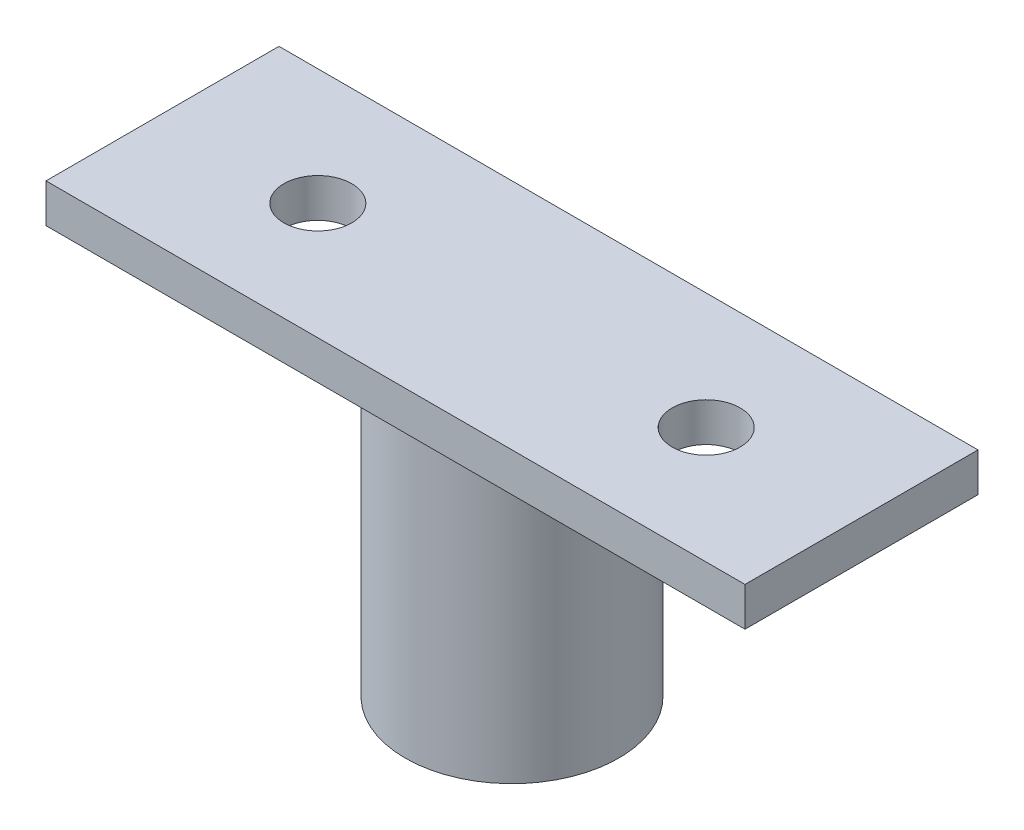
ISO-10303-21;
HEADER;
FILE_DESCRIPTION(('STEP AP214'),'2;1');
FILE_NAME('part.step','',(''),(''),'','','');
FILE_SCHEMA(('AUTOMOTIVE_DESIGN { 1 0 10303 214 1 1 1 1 }'));
ENDSEC;
DATA;
#1=APPLICATION_CONTEXT('core data for automotive mechanical design processes');
#2=APPLICATION_PROTOCOL_DEFINITION('international standard','automotive_design',2000,#1);
#3=PRODUCT_CONTEXT('',#1,'mechanical');
#4=PRODUCT('Part','Part','',(#3));
#5=PRODUCT_RELATED_PRODUCT_CATEGORY('part','',(#4));
#6=PRODUCT_DEFINITION_FORMATION('','',#4);
#7=PRODUCT_DEFINITION_CONTEXT('part definition',#1,'design');
#8=PRODUCT_DEFINITION('design','',#6,#7);
#9=PRODUCT_DEFINITION_SHAPE('','',#8);
#10=(LENGTH_UNIT() NAMED_UNIT(*) SI_UNIT(.MILLI.,.METRE.));
#11=(NAMED_UNIT(*) PLANE_ANGLE_UNIT() SI_UNIT($,.RADIAN.));
#12=(NAMED_UNIT(*) SI_UNIT($,.STERADIAN.) SOLID_ANGLE_UNIT());
#13=UNCERTAINTY_MEASURE_WITH_UNIT(LENGTH_MEASURE(1.E-05),#10,'distance_accuracy_value','');
#14=(GEOMETRIC_REPRESENTATION_CONTEXT(3) GLOBAL_UNCERTAINTY_ASSIGNED_CONTEXT((#13)) GLOBAL_UNIT_ASSIGNED_CONTEXT((#10,
#11,#12)) REPRESENTATION_CONTEXT('',''));
#15=CARTESIAN_POINT('',(0.,0.,0.));
#16=DIRECTION('',(0.,0.,1.));
#17=DIRECTION('',(1.,0.,0.));
#18=AXIS2_PLACEMENT_3D('',#15,#16,#17);
#19=CARTESIAN_POINT('',(0.,0.,0.));
#20=DIRECTION('',(0.,1.,0.));
#21=DIRECTION('',(0.,0.,1.));
#22=AXIS2_PLACEMENT_3D('',#19,#20,#21);
#23=PLANE('',#22);
#24=CARTESIAN_POINT('',(0.,0.,0.));
#25=DIRECTION('',(0.,1.,0.));
#26=DIRECTION('',(0.,0.,1.));
#27=AXIS2_PLACEMENT_3D('',#24,#25,#26);
#28=CIRCLE('',#27,5.5);
#29=CARTESIAN_POINT('',(0.,0.,5.5));
#30=VERTEX_POINT('',#29);
#31=EDGE_CURVE('E34',#30,#30,#28,.T.);
#32=ORIENTED_EDGE('',*,*,#31,.F.);
#33=EDGE_LOOP('',(#32));
#34=FACE_BOUND('',#33,.T.);
#35=CARTESIAN_POINT('',(0.,0.,0.));
#36=DIRECTION('',(0.,1.,0.));
#37=DIRECTION('',(0.,0.,1.));
#38=AXIS2_PLACEMENT_3D('',#35,#36,#37);
#39=CIRCLE('',#38,4.);
#40=CARTESIAN_POINT('',(0.,0.,4.));
#41=VERTEX_POINT('',#40);
#42=EDGE_CURVE('E111',#41,#41,#39,.T.);
#43=ORIENTED_EDGE('',*,*,#42,.T.);
#44=EDGE_LOOP('',(#43));
#45=FACE_BOUND('',#44,.T.);
#46=ADVANCED_FACE('F30',(#34,#45),#23,.F.);
#47=CARTESIAN_POINT('',(0.,15.,0.));
#48=DIRECTION('',(0.,-1.,0.));
#49=DIRECTION('',(0.,0.,-1.));
#50=AXIS2_PLACEMENT_3D('',#47,#48,#49);
#51=CYLINDRICAL_SURFACE('',#50,5.5);
#52=CARTESIAN_POINT('',(0.,15.,0.));
#53=DIRECTION('',(0.,1.,0.));
#54=DIRECTION('',(0.,0.,1.));
#55=AXIS2_PLACEMENT_3D('',#52,#53,#54);
#56=CIRCLE('',#55,5.5);
#57=CARTESIAN_POINT('',(0.,15.,5.5));
#58=VERTEX_POINT('',#57);
#59=EDGE_CURVE('E11',#58,#58,#56,.T.);
#60=ORIENTED_EDGE('',*,*,#59,.F.);
#61=EDGE_LOOP('',(#60));
#62=FACE_BOUND('',#61,.T.);
#63=ORIENTED_EDGE('',*,*,#31,.T.);
#64=EDGE_LOOP('',(#63));
#65=FACE_BOUND('',#64,.T.);
#66=ADVANCED_FACE('F32',(#62,#65),#51,.T.);
#67=CARTESIAN_POINT('',(0.,15.,0.));
#68=DIRECTION('',(0.,-1.,0.));
#69=DIRECTION('',(0.,0.,-1.));
#70=AXIS2_PLACEMENT_3D('',#67,#68,#69);
#71=CYLINDRICAL_SURFACE('',#70,4.);
#72=CARTESIAN_POINT('',(0.,15.,0.));
#73=DIRECTION('',(0.,1.,0.));
#74=DIRECTION('',(0.,0.,1.));
#75=AXIS2_PLACEMENT_3D('',#72,#73,#74);
#76=CIRCLE('',#75,4.);
#77=CARTESIAN_POINT('',(0.,15.,4.));
#78=VERTEX_POINT('',#77);
#79=EDGE_CURVE('E108',#78,#78,#76,.T.);
#80=ORIENTED_EDGE('',*,*,#79,.T.);
#81=EDGE_LOOP('',(#80));
#82=FACE_BOUND('',#81,.T.);
#83=ORIENTED_EDGE('',*,*,#42,.F.);
#84=EDGE_LOOP('',(#83));
#85=FACE_BOUND('',#84,.T.);
#86=ADVANCED_FACE('F123',(#82,#85),#71,.F.);
#87=CARTESIAN_POINT('',(-18.,15.,6.));
#88=DIRECTION('',(0.,1.,0.));
#89=DIRECTION('',(0.,0.,1.));
#90=AXIS2_PLACEMENT_3D('',#87,#88,#89);
#91=PLANE('',#90);
#92=ORIENTED_EDGE('',*,*,#79,.F.);
#93=EDGE_LOOP('',(#92));
#94=FACE_BOUND('',#93,.T.);
#95=ADVANCED_FACE('F128',(#94),#91,.F.);
#96=CARTESIAN_POINT('',(10.,15.,0.));
#97=DIRECTION('',(0.,1.,0.));
#98=DIRECTION('',(0.,0.,1.));
#99=AXIS2_PLACEMENT_3D('',#96,#97,#98);
#100=CIRCLE('',#99,1.75);
#101=CARTESIAN_POINT('',(10.,15.,1.74999999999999));
#102=VERTEX_POINT('',#101);
#103=EDGE_CURVE('E160',#102,#102,#100,.T.);
#104=ORIENTED_EDGE('',*,*,#103,.T.);
#105=EDGE_LOOP('',(#104));
#106=FACE_BOUND('',#105,.T.);
#107=CARTESIAN_POINT('',(-10.,15.,0.));
#108=DIRECTION('',(0.,1.,0.));
#109=DIRECTION('',(0.,0.,1.));
#110=AXIS2_PLACEMENT_3D('',#107,#108,#109);
#111=CIRCLE('',#110,1.75);
#112=CARTESIAN_POINT('',(-10.,15.,1.75));
#113=VERTEX_POINT('',#112);
#114=EDGE_CURVE('E101',#113,#113,#111,.T.);
#115=ORIENTED_EDGE('',*,*,#114,.T.);
#116=EDGE_LOOP('',(#115));
#117=FACE_BOUND('',#116,.T.);
#118=DIRECTION('',(0.,0.,1.));
#119=VECTOR('',#118,1.);
#120=CARTESIAN_POINT('',(-18.,15.,-6.));
#121=LINE('',#120,#119);
#122=CARTESIAN_POINT('',(-18.,15.,-6.));
#123=VERTEX_POINT('',#122);
#124=CARTESIAN_POINT('',(-18.,15.,6.));
#125=VERTEX_POINT('',#124);
#126=EDGE_CURVE('E98',#123,#125,#121,.T.);
#127=ORIENTED_EDGE('',*,*,#126,.F.);
#128=DIRECTION('',(-1.,0.,0.));
#129=VECTOR('',#128,1.);
#130=CARTESIAN_POINT('',(-18.,15.,-6.));
#131=LINE('',#130,#129);
#132=CARTESIAN_POINT('',(18.,15.,-6.));
#133=VERTEX_POINT('',#132);
#134=EDGE_CURVE('E70',#133,#123,#131,.T.);
#135=ORIENTED_EDGE('',*,*,#134,.F.);
#136=DIRECTION('',(0.,0.,-1.));
#137=VECTOR('',#136,1.);
#138=CARTESIAN_POINT('',(18.,15.,-6.));
#139=LINE('',#138,#137);
#140=CARTESIAN_POINT('',(18.,15.,6.));
#141=VERTEX_POINT('',#140);
#142=EDGE_CURVE('E64',#141,#133,#139,.T.);
#143=ORIENTED_EDGE('',*,*,#142,.F.);
#144=DIRECTION('',(1.,0.,0.));
#145=VECTOR('',#144,1.);
#146=CARTESIAN_POINT('',(-18.,15.,6.));
#147=LINE('',#146,#145);
#148=EDGE_CURVE('E88',#125,#141,#147,.T.);
#149=ORIENTED_EDGE('',*,*,#148,.F.);
#150=EDGE_LOOP('',(#127,#135,#143,#149));
#151=FACE_BOUND('',#150,.T.);
#152=ORIENTED_EDGE('',*,*,#59,.T.);
#153=EDGE_LOOP('',(#152));
#154=FACE_BOUND('',#153,.T.);
#155=ADVANCED_FACE('F133',(#106,#117,#151,#154),#91,.F.);
#156=CARTESIAN_POINT('',(-18.,17.,-6.));
#157=DIRECTION('',(1.,0.,0.));
#158=DIRECTION('',(0.,0.,-1.));
#159=AXIS2_PLACEMENT_3D('',#156,#157,#158);
#160=PLANE('',#159);
#161=ORIENTED_EDGE('',*,*,#126,.T.);
#162=DIRECTION('',(0.,-1.,0.));
#163=VECTOR('',#162,1.);
#164=CARTESIAN_POINT('',(-18.,17.,6.));
#165=LINE('',#164,#163);
#166=CARTESIAN_POINT('',(-18.,17.,6.));
#167=VERTEX_POINT('',#166);
#168=EDGE_CURVE('E89',#167,#125,#165,.T.);
#169=ORIENTED_EDGE('',*,*,#168,.F.);
#170=DIRECTION('',(0.,0.,1.));
#171=VECTOR('',#170,1.);
#172=CARTESIAN_POINT('',(-18.,17.,-6.));
#173=LINE('',#172,#171);
#174=CARTESIAN_POINT('',(-18.,17.,-6.));
#175=VERTEX_POINT('',#174);
#176=EDGE_CURVE('E83',#175,#167,#173,.T.);
#177=ORIENTED_EDGE('',*,*,#176,.F.);
#178=DIRECTION('',(0.,-1.,0.));
#179=VECTOR('',#178,1.);
#180=CARTESIAN_POINT('',(-18.,17.,-6.));
#181=LINE('',#180,#179);
#182=EDGE_CURVE('E94',#175,#123,#181,.T.);
#183=ORIENTED_EDGE('',*,*,#182,.T.);
#184=EDGE_LOOP('',(#161,#169,#177,#183));
#185=FACE_BOUND('',#184,.T.);
#186=ADVANCED_FACE('F130',(#185),#160,.F.);
#187=CARTESIAN_POINT('',(-18.,17.,6.));
#188=DIRECTION('',(0.,0.,-1.));
#189=DIRECTION('',(-1.,0.,0.));
#190=AXIS2_PLACEMENT_3D('',#187,#188,#189);
#191=PLANE('',#190);
#192=ORIENTED_EDGE('',*,*,#148,.T.);
#193=DIRECTION('',(0.,-1.,0.));
#194=VECTOR('',#193,1.);
#195=CARTESIAN_POINT('',(18.,17.,6.));
#196=LINE('',#195,#194);
#197=CARTESIAN_POINT('',(18.,17.,6.));
#198=VERTEX_POINT('',#197);
#199=EDGE_CURVE('E86',#198,#141,#196,.T.);
#200=ORIENTED_EDGE('',*,*,#199,.F.);
#201=DIRECTION('',(1.,0.,0.));
#202=VECTOR('',#201,1.);
#203=CARTESIAN_POINT('',(-18.,17.,6.));
#204=LINE('',#203,#202);
#205=EDGE_CURVE('E78',#167,#198,#204,.T.);
#206=ORIENTED_EDGE('',*,*,#205,.F.);
#207=ORIENTED_EDGE('',*,*,#168,.T.);
#208=EDGE_LOOP('',(#192,#200,#206,#207));
#209=FACE_BOUND('',#208,.T.);
#210=ADVANCED_FACE('F87',(#209),#191,.F.);
#211=CARTESIAN_POINT('',(18.,17.,-6.));
#212=DIRECTION('',(-1.,0.,0.));
#213=DIRECTION('',(0.,0.,1.));
#214=AXIS2_PLACEMENT_3D('',#211,#212,#213);
#215=PLANE('',#214);
#216=ORIENTED_EDGE('',*,*,#142,.T.);
#217=DIRECTION('',(0.,-1.,0.));
#218=VECTOR('',#217,1.);
#219=CARTESIAN_POINT('',(18.,17.,-6.));
#220=LINE('',#219,#218);
#221=CARTESIAN_POINT('',(18.,17.,-6.));
#222=VERTEX_POINT('',#221);
#223=EDGE_CURVE('E90',#222,#133,#220,.T.);
#224=ORIENTED_EDGE('',*,*,#223,.F.);
#225=DIRECTION('',(0.,0.,-1.));
#226=VECTOR('',#225,1.);
#227=CARTESIAN_POINT('',(18.,17.,-6.));
#228=LINE('',#227,#226);
#229=EDGE_CURVE('E81',#198,#222,#228,.T.);
#230=ORIENTED_EDGE('',*,*,#229,.F.);
#231=ORIENTED_EDGE('',*,*,#199,.T.);
#232=EDGE_LOOP('',(#216,#224,#230,#231));
#233=FACE_BOUND('',#232,.T.);
#234=ADVANCED_FACE('F92',(#233),#215,.F.);
#235=CARTESIAN_POINT('',(-18.,17.,-6.));
#236=DIRECTION('',(0.,0.,1.));
#237=DIRECTION('',(1.,0.,0.));
#238=AXIS2_PLACEMENT_3D('',#235,#236,#237);
#239=PLANE('',#238);
#240=ORIENTED_EDGE('',*,*,#134,.T.);
#241=ORIENTED_EDGE('',*,*,#182,.F.);
#242=DIRECTION('',(-1.,0.,0.));
#243=VECTOR('',#242,1.);
#244=CARTESIAN_POINT('',(-18.,17.,-6.));
#245=LINE('',#244,#243);
#246=EDGE_CURVE('E47',#222,#175,#245,.T.);
#247=ORIENTED_EDGE('',*,*,#246,.F.);
#248=ORIENTED_EDGE('',*,*,#223,.T.);
#249=EDGE_LOOP('',(#240,#241,#247,#248));
#250=FACE_BOUND('',#249,.T.);
#251=ADVANCED_FACE('F139',(#250),#239,.F.);
#252=CARTESIAN_POINT('',(-18.,17.,6.));
#253=DIRECTION('',(0.,1.,0.));
#254=DIRECTION('',(0.,0.,1.));
#255=AXIS2_PLACEMENT_3D('',#252,#253,#254);
#256=PLANE('',#255);
#257=CARTESIAN_POINT('',(10.,17.,0.));
#258=DIRECTION('',(0.,1.,0.));
#259=DIRECTION('',(0.,0.,1.));
#260=AXIS2_PLACEMENT_3D('',#257,#258,#259);
#261=CIRCLE('',#260,1.75);
#262=CARTESIAN_POINT('',(10.,17.,1.74999999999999));
#263=VERTEX_POINT('',#262);
#264=EDGE_CURVE('E163',#263,#263,#261,.T.);
#265=ORIENTED_EDGE('',*,*,#264,.F.);
#266=EDGE_LOOP('',(#265));
#267=FACE_BOUND('',#266,.T.);
#268=CARTESIAN_POINT('',(-10.,17.,0.));
#269=DIRECTION('',(0.,1.,0.));
#270=DIRECTION('',(0.,0.,1.));
#271=AXIS2_PLACEMENT_3D('',#268,#269,#270);
#272=CIRCLE('',#271,1.75);
#273=CARTESIAN_POINT('',(-10.,17.,1.75));
#274=VERTEX_POINT('',#273);
#275=EDGE_CURVE('E165',#274,#274,#272,.T.);
#276=ORIENTED_EDGE('',*,*,#275,.F.);
#277=EDGE_LOOP('',(#276));
#278=FACE_BOUND('',#277,.T.);
#279=ORIENTED_EDGE('',*,*,#176,.T.);
#280=ORIENTED_EDGE('',*,*,#205,.T.);
#281=ORIENTED_EDGE('',*,*,#229,.T.);
#282=ORIENTED_EDGE('',*,*,#246,.T.);
#283=EDGE_LOOP('',(#279,#280,#281,#282));
#284=FACE_BOUND('',#283,.T.);
#285=ADVANCED_FACE('F79',(#267,#278,#284),#256,.T.);
#286=CARTESIAN_POINT('',(-10.,15.,0.));
#287=DIRECTION('',(0.,1.,0.));
#288=DIRECTION('',(0.,0.,1.));
#289=AXIS2_PLACEMENT_3D('',#286,#287,#288);
#290=CYLINDRICAL_SURFACE('',#289,1.75);
#291=ORIENTED_EDGE('',*,*,#114,.F.);
#292=EDGE_LOOP('',(#291));
#293=FACE_BOUND('',#292,.T.);
#294=ORIENTED_EDGE('',*,*,#275,.T.);
#295=EDGE_LOOP('',(#294));
#296=FACE_BOUND('',#295,.T.);
#297=ADVANCED_FACE('F147',(#293,#296),#290,.F.);
#298=CARTESIAN_POINT('',(10.,15.,0.));
#299=DIRECTION('',(0.,1.,0.));
#300=DIRECTION('',(0.,0.,1.));
#301=AXIS2_PLACEMENT_3D('',#298,#299,#300);
#302=CYLINDRICAL_SURFACE('',#301,1.75);
#303=ORIENTED_EDGE('',*,*,#103,.F.);
#304=EDGE_LOOP('',(#303));
#305=FACE_BOUND('',#304,.T.);
#306=ORIENTED_EDGE('',*,*,#264,.T.);
#307=EDGE_LOOP('',(#306));
#308=FACE_BOUND('',#307,.T.);
#309=ADVANCED_FACE('F151',(#305,#308),#302,.F.);
#310=CLOSED_SHELL('',(#46,#66,#86,#95,#155,#186,#210,#234,#251,#285,#297,#309));
#311=MANIFOLD_SOLID_BREP('B2',#310);
#312=ADVANCED_BREP_SHAPE_REPRESENTATION('',(#18,#311),#14);
#313=SHAPE_DEFINITION_REPRESENTATION(#9,#312);
ENDSEC;
END-ISO-10303-21;
